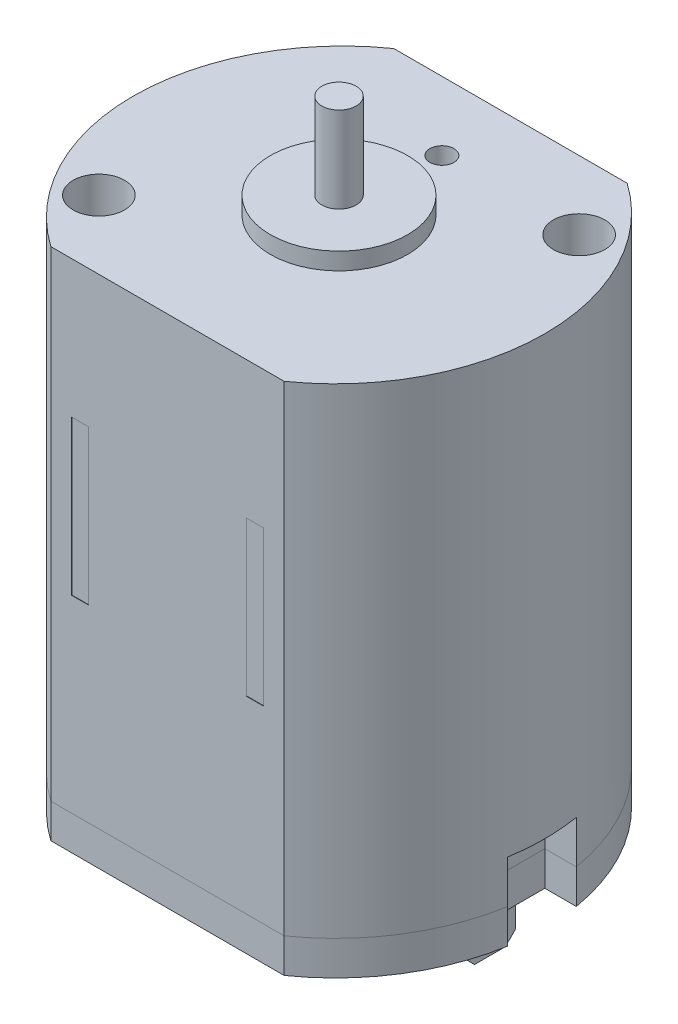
from build123d import *

# Parameters (mm, degrees)
SALIENTE_EXTRUIR1_DEPTH = 1
SALIENTE_EXTRUIR2_DEPTH = 14
CROQUIS3_W              = 0.5
CROQUIS3_H              = 4.5
CORTAR_EXTRUIR1_DEPTH   = 0.01
CORTAR_EXTRUIR2_DEPTH   = 2.25
CROQUIS5_R              = 2.5
SALIENTE_EXTRUIR3_DEPTH = 1
CROQUIS6_R              = 1
CORTAR_EXTRUIR3_DEPTH   = 0.5
CROQUIS7_W              = 0.3
CROQUIS7_H              = 1.5
SALIENTE_EXTRUIR4_DEPTH = 1.5
CROQUIS8_R              = 0.5
CORTAR_EXTRUIR4_DEPTH   = 1
CHAFL_N1_SIZE           = 0.3
CROQUIS9_R              = 0.75
CORTAR_EXTRUIR5_DEPTH   = 0.05
CROQUIS10_R             = 0.25
CORTAR_EXTRUIR6_DEPTH   = 1
CROQUIS11_R             = 0.75
CORTAR_EXTRUIR7_DEPTH   = 0.05
CROQUIS12_R             = 2
SALIENTE_EXTRUIR5_DEPTH = 0.5
CROQUIS13_R             = 0.5
SALIENTE_EXTRUIR6_DEPTH = 2.5
CROQUIS14_R             = 0.75
CROQUIS14_R_2           = 0.35
CORTAR_EXTRUIR8_DEPTH   = 2.5


with BuildPart() as part:
    # Croquis1 → Saliente-Extruir1 (new body)
    with BuildSketch(Plane(origin=(0, 0, 0), x_dir=(1, 0, 0), z_dir=(0, 1, 0))):
        with BuildLine():
            Line((-3.4, 5), (3.4, 5))
            ThreePointArc((3.4, 5), (6, 0), (3.4, -5))
            Line((3.4, -5), (-3.4, -5))
            ThreePointArc((-3.4, -5), (-6, 0), (-3.4, 5))
        make_face()
    extrude(amount=SALIENTE_EXTRUIR1_DEPTH)


with BuildPart() as body_2:
    # Croquis2 → Saliente-Extruir2 (new body)
    with BuildSketch(Plane(origin=(0, 1, 0), x_dir=(1, 0, 0), z_dir=(0, 1, 0))):
        with BuildLine():
            Line((-3.4, 5), (3.4, 5))
            ThreePointArc((3.4, 5), (6, 0), (3.4, -5))
            Line((3.4, -5), (-3.4, -5))
            ThreePointArc((-3.4, -5), (-6, 0), (-3.4, 5))
        make_face()
    extrude(amount=SALIENTE_EXTRUIR2_DEPTH)

    # Croquis3 → Cortar-Extruir1 (cut)
    with BuildSketch(Plane.XY.offset(5)):
        with Locations((-2.55, 8.75)):
            Rectangle(CROQUIS3_W, CROQUIS3_H)
        with Locations((2.55, 8.75)):
            Rectangle(CROQUIS3_W, CROQUIS3_H)
    cortar_extruir1 = extrude(amount=-CORTAR_EXTRUIR1_DEPTH, mode=Mode.SUBTRACT)

    # Simetr_a2: Cortar-Extruir1 across plane
    add(cortar_extruir1.mirror(Plane.XY), mode=Mode.SUBTRACT)


with BuildPart() as cortar_extruir2_tool:
    # Croquis4 → Cortar-Extruir2 (new body)
    with BuildSketch(Plane.XZ):
        with BuildLine():
            Line((5, 1), (5, -1))
            Line((5, -1), (5.917579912, -1))
            ThreePointArc((5.917579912, -1), (6, 0), (5.917579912, 1))
            Line((5.917579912, 1), (5, 1))
        make_face()
        with BuildLine():
            Line((-5, 1), (-5.917579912, 1))
            ThreePointArc((-5.917579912, 1), (-6, 0), (-5.917579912, -1))
            Line((-5.917579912, -1), (-5, -1))
            Line((-5, -1), (-5, 1))
        make_face()
    extrude(amount=-CORTAR_EXTRUIR2_DEPTH)


with BuildPart() as part_1:
    add(part.part)

    # Cortar-Extruir2: cut by cortar_extruir2_tool
    add(cortar_extruir2_tool.part, mode=Mode.SUBTRACT)

    # Croquis5 → Saliente-Extruir3 (add)
    with BuildSketch(Plane.XZ):
        with Locations(Location((0, 0, 0), (0, 0, 270))):
            Circle(CROQUIS5_R)
    extrude(amount=SALIENTE_EXTRUIR3_DEPTH)

    # Croquis6 → Cortar-Extruir3 (cut)
    with BuildSketch(Plane.XZ.offset(1)):
        with Locations(Location((0, 0, 0), (0, 0, 270))):
            Circle(CROQUIS6_R)
    extrude(amount=-CORTAR_EXTRUIR3_DEPTH, mode=Mode.SUBTRACT)

    # Croquis7 → Saliente-Extruir4 (add)
    with BuildSketch(Plane.XZ):
        with Locations((4.25, 0)):
            Rectangle(CROQUIS7_W, CROQUIS7_H)
        with Locations((-4.25, 0)):
            Rectangle(CROQUIS7_W, CROQUIS7_H)
    extrude(amount=SALIENTE_EXTRUIR4_DEPTH)

    # Croquis8 → Cortar-Extruir4 (cut)
    with BuildSketch(Plane(origin=(4.4, 0, 0), x_dir=(0, 0, -1), z_dir=(1, 0, 0))):
        with Locations((0, -0.75)):
            Circle(CROQUIS8_R)
    cortar_extruir4 = extrude(amount=-CORTAR_EXTRUIR4_DEPTH, mode=Mode.SUBTRACT)

    # Simetr_a3: Cortar-Extruir4 across plane
    add(cortar_extruir4.mirror(Plane(origin=(0, 0, 0), x_dir=(0, 0, 1), z_dir=(1, 0, 0))), mode=Mode.SUBTRACT)

    # Chafl_n1
    chafl_n1_edges = [part_1.edges().sort_by_distance(p)[0] for p in [
        (4.25, -1.5, 0.75),
        (4.25, -1.5, -0.75),
        (-4.25, -1.5, 0.75),
        (-4.25, -1.5, -0.75),
    ]]
    chamfer(chafl_n1_edges, length=CHAFL_N1_SIZE)

    # Croquis9 → Cortar-Extruir5 (cut)
    with BuildSketch(Plane.XZ):
        with Locations(Location((2.689144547, 3.086404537, 0), (0, 0, 270))):
            Circle(CROQUIS9_R)
        with Locations(Location((0, -3.660903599, 0), (0, 0, 270))):
            Circle(CROQUIS9_R)
    extrude(amount=-CORTAR_EXTRUIR5_DEPTH, mode=Mode.SUBTRACT)


with BuildPart() as body_2_1:
    add(body_2.part)

    # Cortar-Extruir2: cut by cortar_extruir2_tool
    add(cortar_extruir2_tool.part, mode=Mode.SUBTRACT)


with BuildPart() as cortar_extruir6_tool:
    # Croquis10 → Cortar-Extruir6 (new body)
    with BuildSketch(Plane.XZ.offset(-0.05)):
        with Locations(Location((2.689144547, 3.086404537, 0), (0, 0, 270))):
            Circle(CROQUIS10_R)
    extrude(amount=-CORTAR_EXTRUIR6_DEPTH)


with BuildPart() as part_2:
    add(part_1.part)

    # Cortar-Extruir6: cut by cortar_extruir6_tool
    add(cortar_extruir6_tool.part, mode=Mode.SUBTRACT)

    # Croquis11 → Cortar-Extruir7 (cut)
    with BuildSketch(Plane.XZ):
        with Locations(Location((-2.687365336, 3.086404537, 0), (0, 0, 90))):
            Circle(CROQUIS11_R)
        with BuildLine():
            Line((-2.637365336, 3.794778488), (-2.637365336, 3.136404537))
            Line((-2.637365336, 3.136404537), (-1.97177306, 3.136404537))
            ThreePointArc((-1.97177306, 3.136404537), (-1.970028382, 3.086404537), (-1.97177306, 3.036404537))
            Line((-1.97177306, 3.036404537), (-2.637365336, 3.036404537))
            Line((-2.637365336, 3.036404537), (-2.637365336, 2.378030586))
            Line((-2.637365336, 2.378030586), (-2.637365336, 2.370812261))
            ThreePointArc((-2.637365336, 2.370812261), (-2.687365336, 2.369067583), (-2.737365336, 2.370812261))
            Line((-2.737365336, 2.370812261), (-2.737365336, 2.378030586))
            Line((-2.737365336, 2.378030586), (-2.737365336, 3.036404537))
            Line((-2.737365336, 3.036404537), (-3.402957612, 3.036404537))
            ThreePointArc((-3.402957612, 3.036404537), (-3.40470229, 3.086404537), (-3.402957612, 3.136404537))
            Line((-3.402957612, 3.136404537), (-2.737365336, 3.136404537))
            Line((-2.737365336, 3.136404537), (-2.737365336, 3.794778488))
            Line((-2.737365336, 3.794778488), (-2.737365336, 3.801996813))
            ThreePointArc((-2.737365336, 3.801996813), (-2.687365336, 3.803741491), (-2.637365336, 3.801996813))
            Line((-2.637365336, 3.801996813), (-2.637365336, 3.794778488))
        make_face(mode=Mode.SUBTRACT)
    extrude(amount=-CORTAR_EXTRUIR7_DEPTH, mode=Mode.SUBTRACT)


with BuildPart() as body_2_2:
    add(body_2_1.part)

    # Cortar-Extruir6: cut by cortar_extruir6_tool
    add(cortar_extruir6_tool.part, mode=Mode.SUBTRACT)

    # Croquis14 → Cortar-Extruir8 (cut)
    with BuildSketch(Plane(origin=(0, 15, 0), x_dir=(1, 0, 0), z_dir=(0, 1, 0))):
        with Locations(Location((-4, -3, 0), (0, 0, 270))):
            Circle(CROQUIS14_R)
        with Locations(Location((4, 3, 0), (0, 0, 270))):
            Circle(CROQUIS14_R)
        with Locations(Location((0, 3, 0), (0, 0, 90))):
            Circle(CROQUIS14_R_2)
    extrude(amount=-CORTAR_EXTRUIR8_DEPTH, mode=Mode.SUBTRACT)


with BuildPart() as body_3:
    # Croquis12 → Saliente-Extruir5 (new body)
    with BuildSketch(Plane(origin=(0, 15, 0), x_dir=(1, 0, 0), z_dir=(0, 1, 0))):
        with Locations(Location((0, 0, 0), (0, 0, 270))):
            Circle(CROQUIS12_R)
    extrude(amount=SALIENTE_EXTRUIR5_DEPTH)


with BuildPart() as body_4:
    # Croquis13 → Saliente-Extruir6 (new body)
    with BuildSketch(Plane(origin=(0, 15.5, 0), x_dir=(1, 0, 0), z_dir=(0, 1, 0))):
        with Locations(Location((0, 0, 0), (0, 0, 270))):
            Circle(CROQUIS13_R)
    extrude(amount=SALIENTE_EXTRUIR6_DEPTH)


solid = Compound([part_2.part, body_2_2.part, body_3.part, body_4.part])
